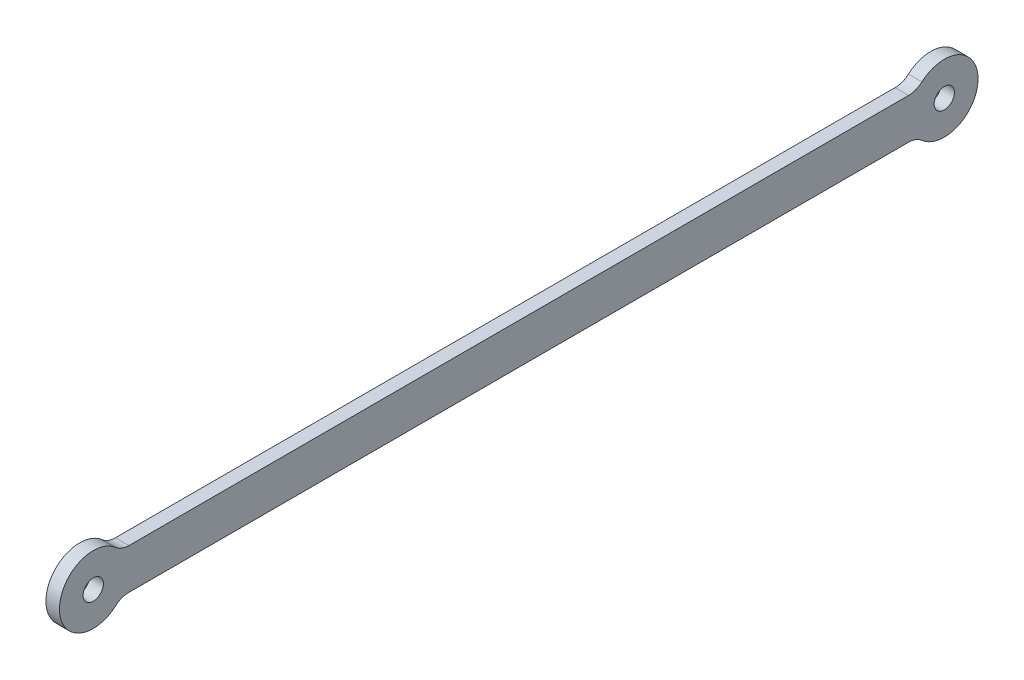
from build123d import *

# Parameters (mm, degrees)
SKETCH1_R           = 1.5
BOSS_EXTRUDE1_DEPTH = 2
BOSS_EXTRUDE2_START = -2
SKETCH2_R           = 5
SKETCH2_R_2         = 1.5
BOSS_EXTRUDE2_DEPTH = 2
FILLET1_R           = 3


with BuildPart() as part:
    # Sketch1 → Boss-Extrude1 (new body)
    with BuildSketch(Plane(origin=(0, 0, 0), x_dir=(0, 0, -1), z_dir=(1, 0, 0))):
        with BuildLine():
            Line((0, -3), (-126, -3))
            ThreePointArc((-126, -3), (-129, 0), (-126, 3))
            Line((-126, 3), (0, 3))
            ThreePointArc((0, 3), (3, 0), (0, -3))
        make_face()
        with Locations((-126, 0)):
            Circle(SKETCH1_R, mode=Mode.SUBTRACT)
        Circle(SKETCH1_R, mode=Mode.SUBTRACT)
    extrude(amount=BOSS_EXTRUDE1_DEPTH)

    # Sketch2 → Boss-Extrude2 (add)
    # profile 1 of 2: a face of its own
    with BuildSketch(Plane(origin=(2, 0, 0), x_dir=(0, 0, -1), z_dir=(1, 0, 0)).offset(BOSS_EXTRUDE2_START)):
        with Locations((-126, 0)):
            Circle(SKETCH2_R)
        with Locations((-126, 0)):
            Circle(SKETCH2_R_2, mode=Mode.SUBTRACT)
    # profile 2 of 2: a face of its own
    with BuildSketch(Plane(origin=(2, 0, 0), x_dir=(0, 0, -1), z_dir=(1, 0, 0)).offset(BOSS_EXTRUDE2_START)):
        Circle(SKETCH2_R)
        Circle(SKETCH2_R_2, mode=Mode.SUBTRACT)
    extrude(amount=BOSS_EXTRUDE2_DEPTH)

    # Fillet1
    fillet1_edges = [part.edges().sort_by_distance(p)[0] for p in [
        (1, -3, 122),
        (1, 3, 122),
        (1, -3, 4),
        (1, 3, 4),
    ]]
    fillet(fillet1_edges, radius=FILLET1_R)


solid = part.part
